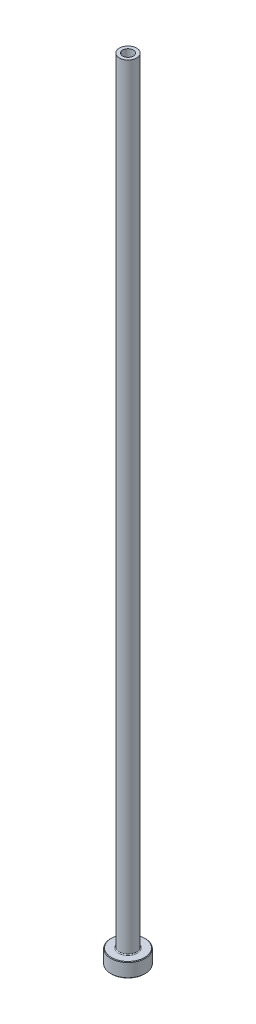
ISO-10303-21;
HEADER;
FILE_DESCRIPTION(('STEP AP214'),'2;1');
FILE_NAME('part.step','',(''),(''),'','','');
FILE_SCHEMA(('AUTOMOTIVE_DESIGN { 1 0 10303 214 1 1 1 1 }'));
ENDSEC;
DATA;
#1=APPLICATION_CONTEXT('core data for automotive mechanical design processes');
#2=APPLICATION_PROTOCOL_DEFINITION('international standard','automotive_design',2000,#1);
#3=PRODUCT_CONTEXT('',#1,'mechanical');
#4=PRODUCT('Part','Part','',(#3));
#5=PRODUCT_RELATED_PRODUCT_CATEGORY('part','',(#4));
#6=PRODUCT_DEFINITION_FORMATION('','',#4);
#7=PRODUCT_DEFINITION_CONTEXT('part definition',#1,'design');
#8=PRODUCT_DEFINITION('design','',#6,#7);
#9=PRODUCT_DEFINITION_SHAPE('','',#8);
#10=(LENGTH_UNIT() NAMED_UNIT(*) SI_UNIT(.MILLI.,.METRE.));
#11=(NAMED_UNIT(*) PLANE_ANGLE_UNIT() SI_UNIT($,.RADIAN.));
#12=(NAMED_UNIT(*) SI_UNIT($,.STERADIAN.) SOLID_ANGLE_UNIT());
#13=UNCERTAINTY_MEASURE_WITH_UNIT(LENGTH_MEASURE(1.E-05),#10,'distance_accuracy_value','');
#14=(GEOMETRIC_REPRESENTATION_CONTEXT(3) GLOBAL_UNCERTAINTY_ASSIGNED_CONTEXT((#13)) GLOBAL_UNIT_ASSIGNED_CONTEXT((#10,
#11,#12)) REPRESENTATION_CONTEXT('',''));
#15=CARTESIAN_POINT('',(0.,0.,0.));
#16=DIRECTION('',(0.,0.,1.));
#17=DIRECTION('',(1.,0.,0.));
#18=AXIS2_PLACEMENT_3D('',#15,#16,#17);
#19=CARTESIAN_POINT('',(0.,92.1876809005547,0.));
#20=DIRECTION('',(0.,1.,0.));
#21=DIRECTION('',(0.,0.,1.));
#22=AXIS2_PLACEMENT_3D('',#19,#20,#21);
#23=CYLINDRICAL_SURFACE('',#22,1.85000000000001);
#24=CARTESIAN_POINT('',(0.,275.,0.));
#25=DIRECTION('',(0.,1.,0.));
#26=DIRECTION('',(0.,0.,1.));
#27=AXIS2_PLACEMENT_3D('',#24,#25,#26);
#28=CIRCLE('',#27,1.85000000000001);
#29=CARTESIAN_POINT('',(0.,275.,1.85000000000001));
#30=VERTEX_POINT('',#29);
#31=EDGE_CURVE('E62',#30,#30,#28,.T.);
#32=ORIENTED_EDGE('',*,*,#31,.T.);
#33=EDGE_LOOP('',(#32));
#34=FACE_BOUND('',#33,.T.);
#35=CARTESIAN_POINT('',(0.,230.,0.));
#36=DIRECTION('',(0.,1.,0.));
#37=DIRECTION('',(0.,0.,1.));
#38=AXIS2_PLACEMENT_3D('',#35,#36,#37);
#39=CIRCLE('',#38,1.85000000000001);
#40=CARTESIAN_POINT('',(0.,230.,1.85000000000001));
#41=VERTEX_POINT('',#40);
#42=EDGE_CURVE('E71',#41,#41,#39,.T.);
#43=ORIENTED_EDGE('',*,*,#42,.F.);
#44=EDGE_LOOP('',(#43));
#45=FACE_BOUND('',#44,.T.);
#46=ADVANCED_FACE('F30',(#34,#45),#23,.F.);
#47=CARTESIAN_POINT('',(-1.85000000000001,275.,0.));
#48=DIRECTION('',(0.,1.,0.));
#49=DIRECTION('',(0.,0.,1.));
#50=AXIS2_PLACEMENT_3D('',#47,#48,#49);
#51=PLANE('',#50);
#52=CARTESIAN_POINT('',(0.,275.,0.));
#53=DIRECTION('',(0.,1.,0.));
#54=DIRECTION('',(0.,0.,1.));
#55=AXIS2_PLACEMENT_3D('',#52,#53,#54);
#56=CIRCLE('',#55,3.00000000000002);
#57=CARTESIAN_POINT('',(0.,275.,3.00000000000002));
#58=VERTEX_POINT('',#57);
#59=EDGE_CURVE('E65',#58,#58,#56,.T.);
#60=ORIENTED_EDGE('',*,*,#59,.T.);
#61=EDGE_LOOP('',(#60));
#62=FACE_BOUND('',#61,.T.);
#63=ORIENTED_EDGE('',*,*,#31,.F.);
#64=EDGE_LOOP('',(#63));
#65=FACE_BOUND('',#64,.T.);
#66=ADVANCED_FACE('F79',(#62,#65),#51,.T.);
#67=CARTESIAN_POINT('',(0.,92.1876809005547,0.));
#68=DIRECTION('',(0.,1.,0.));
#69=DIRECTION('',(0.,0.,1.));
#70=AXIS2_PLACEMENT_3D('',#67,#68,#69);
#71=CYLINDRICAL_SURFACE('',#70,3.00000000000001);
#72=CARTESIAN_POINT('',(0.,5.3,0.));
#73=DIRECTION('',(0.,1.,0.));
#74=DIRECTION('',(0.,0.,1.));
#75=AXIS2_PLACEMENT_3D('',#72,#73,#74);
#76=CIRCLE('',#75,3.00000000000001);
#77=CARTESIAN_POINT('',(0.,5.3,3.00000000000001));
#78=VERTEX_POINT('',#77);
#79=EDGE_CURVE('E59',#78,#78,#76,.T.);
#80=ORIENTED_EDGE('',*,*,#79,.T.);
#81=EDGE_LOOP('',(#80));
#82=FACE_BOUND('',#81,.T.);
#83=ORIENTED_EDGE('',*,*,#59,.F.);
#84=EDGE_LOOP('',(#83));
#85=FACE_BOUND('',#84,.T.);
#86=ADVANCED_FACE('F85',(#82,#85),#71,.T.);
#87=CARTESIAN_POINT('',(-2.99999999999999,5.,0.));
#88=DIRECTION('',(0.,1.,0.));
#89=DIRECTION('',(0.,0.,1.));
#90=AXIS2_PLACEMENT_3D('',#87,#88,#89);
#91=PLANE('',#90);
#92=CARTESIAN_POINT('',(0.,5.,0.));
#93=DIRECTION('',(0.,1.,0.));
#94=DIRECTION('',(0.,0.,1.));
#95=AXIS2_PLACEMENT_3D('',#92,#93,#94);
#96=CIRCLE('',#95,5.79999999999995);
#97=CARTESIAN_POINT('',(0.,5.,5.79999999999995));
#98=VERTEX_POINT('',#97);
#99=EDGE_CURVE('E53',#98,#98,#96,.T.);
#100=ORIENTED_EDGE('',*,*,#99,.T.);
#101=EDGE_LOOP('',(#100));
#102=FACE_BOUND('',#101,.T.);
#103=CARTESIAN_POINT('',(0.,5.,0.));
#104=DIRECTION('',(0.,1.,0.));
#105=DIRECTION('',(0.,0.,1.));
#106=AXIS2_PLACEMENT_3D('',#103,#104,#105);
#107=CIRCLE('',#106,3.30000000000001);
#108=CARTESIAN_POINT('',(0.,5.,3.30000000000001));
#109=VERTEX_POINT('',#108);
#110=EDGE_CURVE('E56',#109,#109,#107,.F.);
#111=ORIENTED_EDGE('',*,*,#110,.T.);
#112=EDGE_LOOP('',(#111));
#113=FACE_BOUND('',#112,.T.);
#114=ADVANCED_FACE('F111',(#102,#113),#91,.T.);
#115=CARTESIAN_POINT('',(0.,92.1876809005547,0.));
#116=DIRECTION('',(0.,1.,0.));
#117=DIRECTION('',(0.,0.,1.));
#118=AXIS2_PLACEMENT_3D('',#115,#116,#117);
#119=CYLINDRICAL_SURFACE('',#118,5.99999999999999);
#120=CARTESIAN_POINT('',(0.,4.79999999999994,0.));
#121=DIRECTION('',(0.,1.,0.));
#122=DIRECTION('',(0.,0.,1.));
#123=AXIS2_PLACEMENT_3D('',#120,#121,#122);
#124=CIRCLE('',#123,5.99999999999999);
#125=CARTESIAN_POINT('',(0.,4.79999999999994,5.99999999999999));
#126=VERTEX_POINT('',#125);
#127=EDGE_CURVE('E45',#126,#126,#124,.F.);
#128=ORIENTED_EDGE('',*,*,#127,.T.);
#129=EDGE_LOOP('',(#128));
#130=FACE_BOUND('',#129,.T.);
#131=CARTESIAN_POINT('',(0.,0.199999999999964,0.));
#132=DIRECTION('',(0.,-1.,0.));
#133=DIRECTION('',(0.,0.,-1.));
#134=AXIS2_PLACEMENT_3D('',#131,#132,#133);
#135=CIRCLE('',#134,5.99999999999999);
#136=CARTESIAN_POINT('',(0.,0.199999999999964,-5.99999999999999));
#137=VERTEX_POINT('',#136);
#138=EDGE_CURVE('E50',#137,#137,#135,.F.);
#139=ORIENTED_EDGE('',*,*,#138,.T.);
#140=EDGE_LOOP('',(#139));
#141=FACE_BOUND('',#140,.T.);
#142=ADVANCED_FACE('F108',(#130,#141),#119,.T.);
#143=CARTESIAN_POINT('',(-5.99999999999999,0.,0.));
#144=DIRECTION('',(0.,-1.,0.));
#145=DIRECTION('',(0.,0.,-1.));
#146=AXIS2_PLACEMENT_3D('',#143,#144,#145);
#147=PLANE('',#146);
#148=CARTESIAN_POINT('',(0.,0.,0.));
#149=DIRECTION('',(0.,-1.,0.));
#150=DIRECTION('',(0.,0.,-1.));
#151=AXIS2_PLACEMENT_3D('',#148,#149,#150);
#152=CIRCLE('',#151,2.59999999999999);
#153=CARTESIAN_POINT('',(0.,0.,-2.59999999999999));
#154=VERTEX_POINT('',#153);
#155=EDGE_CURVE('E37',#154,#154,#152,.F.);
#156=ORIENTED_EDGE('',*,*,#155,.T.);
#157=EDGE_LOOP('',(#156));
#158=FACE_BOUND('',#157,.T.);
#159=CARTESIAN_POINT('',(0.,0.,0.));
#160=DIRECTION('',(0.,-1.,0.));
#161=DIRECTION('',(0.,0.,-1.));
#162=AXIS2_PLACEMENT_3D('',#159,#160,#161);
#163=CIRCLE('',#162,5.80000000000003);
#164=CARTESIAN_POINT('',(0.,0.,-5.80000000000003));
#165=VERTEX_POINT('',#164);
#166=EDGE_CURVE('E41',#165,#165,#163,.T.);
#167=ORIENTED_EDGE('',*,*,#166,.T.);
#168=EDGE_LOOP('',(#167));
#169=FACE_BOUND('',#168,.T.);
#170=ADVANCED_FACE('F110',(#158,#169),#147,.T.);
#171=CARTESIAN_POINT('',(0.,92.1876809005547,0.));
#172=DIRECTION('',(0.,1.,0.));
#173=DIRECTION('',(0.,0.,1.));
#174=AXIS2_PLACEMENT_3D('',#171,#172,#173);
#175=CYLINDRICAL_SURFACE('',#174,2.1);
#176=CARTESIAN_POINT('',(0.,0.500000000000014,0.));
#177=DIRECTION('',(0.,-1.,0.));
#178=DIRECTION('',(0.,0.,-1.));
#179=AXIS2_PLACEMENT_3D('',#176,#177,#178);
#180=CIRCLE('',#179,2.1);
#181=CARTESIAN_POINT('',(0.,0.500000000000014,-2.1));
#182=VERTEX_POINT('',#181);
#183=EDGE_CURVE('E10',#182,#182,#180,.T.);
#184=ORIENTED_EDGE('',*,*,#183,.T.);
#185=EDGE_LOOP('',(#184));
#186=FACE_BOUND('',#185,.T.);
#187=CARTESIAN_POINT('',(0.,218.,0.));
#188=DIRECTION('',(0.,1.,0.));
#189=DIRECTION('',(0.,0.,1.));
#190=AXIS2_PLACEMENT_3D('',#187,#188,#189);
#191=CIRCLE('',#190,2.10000000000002);
#192=CARTESIAN_POINT('',(0.,218.,2.10000000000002));
#193=VERTEX_POINT('',#192);
#194=EDGE_CURVE('E68',#193,#193,#191,.T.);
#195=ORIENTED_EDGE('',*,*,#194,.T.);
#196=EDGE_LOOP('',(#195));
#197=FACE_BOUND('',#196,.T.);
#198=ADVANCED_FACE('F118',(#186,#197),#175,.F.);
#199=CARTESIAN_POINT('',(0.,218.,0.));
#200=DIRECTION('',(0.,-1.,0.));
#201=DIRECTION('',(0.,0.,-1.));
#202=AXIS2_PLACEMENT_3D('',#199,#200,#201);
#203=CONICAL_SURFACE('',#202,2.10000000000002,0.0208303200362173);
#204=ORIENTED_EDGE('',*,*,#42,.T.);
#205=EDGE_LOOP('',(#204));
#206=FACE_BOUND('',#205,.T.);
#207=ORIENTED_EDGE('',*,*,#194,.F.);
#208=EDGE_LOOP('',(#207));
#209=FACE_BOUND('',#208,.T.);
#210=ADVANCED_FACE('F75',(#206,#209),#203,.F.);
#211=CARTESIAN_POINT('',(0.,5.3,0.));
#212=DIRECTION('',(0.,1.,0.));
#213=DIRECTION('',(0.,0.,1.));
#214=AXIS2_PLACEMENT_3D('',#211,#212,#213);
#215=TOROIDAL_SURFACE('',#214,3.30000000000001,0.3);
#216=ORIENTED_EDGE('',*,*,#110,.F.);
#217=EDGE_LOOP('',(#216));
#218=FACE_BOUND('',#217,.T.);
#219=ORIENTED_EDGE('',*,*,#79,.F.);
#220=EDGE_LOOP('',(#219));
#221=FACE_BOUND('',#220,.T.);
#222=ADVANCED_FACE('F90',(#218,#221),#215,.F.);
#223=CARTESIAN_POINT('',(0.,5.,0.));
#224=DIRECTION('',(0.,-1.,0.));
#225=DIRECTION('',(0.,0.,-1.));
#226=AXIS2_PLACEMENT_3D('',#223,#224,#225);
#227=CONICAL_SURFACE('',#226,5.79999999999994,0.785398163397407);
#228=ORIENTED_EDGE('',*,*,#127,.F.);
#229=EDGE_LOOP('',(#228));
#230=FACE_BOUND('',#229,.T.);
#231=ORIENTED_EDGE('',*,*,#99,.F.);
#232=EDGE_LOOP('',(#231));
#233=FACE_BOUND('',#232,.T.);
#234=ADVANCED_FACE('F93',(#230,#233),#227,.T.);
#235=CARTESIAN_POINT('',(0.,0.199999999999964,0.));
#236=DIRECTION('',(0.,1.,0.));
#237=DIRECTION('',(0.,0.,1.));
#238=AXIS2_PLACEMENT_3D('',#235,#236,#237);
#239=CONICAL_SURFACE('',#238,5.99999999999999,0.78539816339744);
#240=ORIENTED_EDGE('',*,*,#166,.F.);
#241=EDGE_LOOP('',(#240));
#242=FACE_BOUND('',#241,.T.);
#243=ORIENTED_EDGE('',*,*,#138,.F.);
#244=EDGE_LOOP('',(#243));
#245=FACE_BOUND('',#244,.T.);
#246=ADVANCED_FACE('F96',(#242,#245),#239,.T.);
#247=CARTESIAN_POINT('',(0.,0.,0.));
#248=DIRECTION('',(0.,-1.,0.));
#249=DIRECTION('',(0.,0.,-1.));
#250=AXIS2_PLACEMENT_3D('',#247,#248,#249);
#251=CONICAL_SURFACE('',#250,2.59999999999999,0.785398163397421);
#252=ORIENTED_EDGE('',*,*,#183,.F.);
#253=EDGE_LOOP('',(#252));
#254=FACE_BOUND('',#253,.T.);
#255=ORIENTED_EDGE('',*,*,#155,.F.);
#256=EDGE_LOOP('',(#255));
#257=FACE_BOUND('',#256,.T.);
#258=ADVANCED_FACE('F32',(#254,#257),#251,.F.);
#259=CLOSED_SHELL('',(#46,#66,#86,#114,#142,#170,#198,#210,#222,#234,#246,#258));
#260=MANIFOLD_SOLID_BREP('B2',#259);
#261=ADVANCED_BREP_SHAPE_REPRESENTATION('',(#18,#260),#14);
#262=SHAPE_DEFINITION_REPRESENTATION(#9,#261);
ENDSEC;
END-ISO-10303-21;
